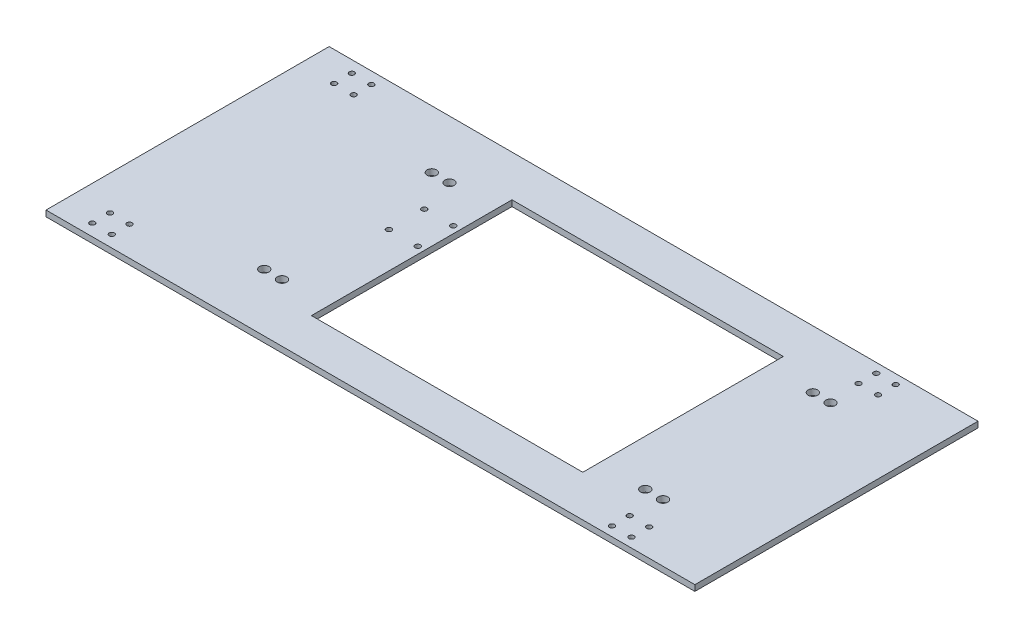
ISO-10303-21;
HEADER;
FILE_DESCRIPTION(('STEP AP214'),'2;1');
FILE_NAME('part.step','',(''),(''),'','','');
FILE_SCHEMA(('AUTOMOTIVE_DESIGN { 1 0 10303 214 1 1 1 1 }'));
ENDSEC;
DATA;
#1=APPLICATION_CONTEXT('core data for automotive mechanical design processes');
#2=APPLICATION_PROTOCOL_DEFINITION('international standard','automotive_design',2000,#1);
#3=PRODUCT_CONTEXT('',#1,'mechanical');
#4=PRODUCT('Part','Part','',(#3));
#5=PRODUCT_RELATED_PRODUCT_CATEGORY('part','',(#4));
#6=PRODUCT_DEFINITION_FORMATION('','',#4);
#7=PRODUCT_DEFINITION_CONTEXT('part definition',#1,'design');
#8=PRODUCT_DEFINITION('design','',#6,#7);
#9=PRODUCT_DEFINITION_SHAPE('','',#8);
#10=(LENGTH_UNIT() NAMED_UNIT(*) SI_UNIT(.MILLI.,.METRE.));
#11=(NAMED_UNIT(*) PLANE_ANGLE_UNIT() SI_UNIT($,.RADIAN.));
#12=(NAMED_UNIT(*) SI_UNIT($,.STERADIAN.) SOLID_ANGLE_UNIT());
#13=UNCERTAINTY_MEASURE_WITH_UNIT(LENGTH_MEASURE(1.E-05),#10,'distance_accuracy_value','');
#14=(GEOMETRIC_REPRESENTATION_CONTEXT(3) GLOBAL_UNCERTAINTY_ASSIGNED_CONTEXT((#13)) GLOBAL_UNIT_ASSIGNED_CONTEXT((#10,
#11,#12)) REPRESENTATION_CONTEXT('',''));
#15=CARTESIAN_POINT('',(0.,0.,0.));
#16=DIRECTION('',(0.,0.,1.));
#17=DIRECTION('',(1.,0.,0.));
#18=AXIS2_PLACEMENT_3D('',#15,#16,#17);
#19=CARTESIAN_POINT('',(-275.,31.5,-120.));
#20=DIRECTION('',(1.,0.,0.));
#21=DIRECTION('',(0.,0.,-1.));
#22=AXIS2_PLACEMENT_3D('',#19,#20,#21);
#23=PLANE('',#22);
#24=DIRECTION('',(0.,-1.,0.));
#25=VECTOR('',#24,1.);
#26=CARTESIAN_POINT('',(-275.,31.5,120.));
#27=LINE('',#26,#25);
#28=CARTESIAN_POINT('',(-275.,5.,120.));
#29=VERTEX_POINT('',#28);
#30=CARTESIAN_POINT('',(-275.,0.,120.));
#31=VERTEX_POINT('',#30);
#32=EDGE_CURVE('E12',#29,#31,#27,.T.);
#33=ORIENTED_EDGE('',*,*,#32,.F.);
#34=DIRECTION('',(0.,0.,1.));
#35=VECTOR('',#34,1.);
#36=CARTESIAN_POINT('',(-275.,5.,-120.));
#37=LINE('',#36,#35);
#38=CARTESIAN_POINT('',(-275.,5.,-120.));
#39=VERTEX_POINT('',#38);
#40=EDGE_CURVE('E99',#39,#29,#37,.T.);
#41=ORIENTED_EDGE('',*,*,#40,.F.);
#42=DIRECTION('',(0.,-1.,0.));
#43=VECTOR('',#42,1.);
#44=CARTESIAN_POINT('',(-275.,31.5,-120.));
#45=LINE('',#44,#43);
#46=CARTESIAN_POINT('',(-275.,0.,-120.));
#47=VERTEX_POINT('',#46);
#48=EDGE_CURVE('E119',#39,#47,#45,.T.);
#49=ORIENTED_EDGE('',*,*,#48,.T.);
#50=DIRECTION('',(0.,0.,1.));
#51=VECTOR('',#50,1.);
#52=CARTESIAN_POINT('',(-275.,0.,-120.));
#53=LINE('',#52,#51);
#54=EDGE_CURVE('E117',#47,#31,#53,.T.);
#55=ORIENTED_EDGE('',*,*,#54,.T.);
#56=EDGE_LOOP('',(#33,#41,#49,#55));
#57=FACE_BOUND('',#56,.T.);
#58=ADVANCED_FACE('F37',(#57),#23,.F.);
#59=CARTESIAN_POINT('',(275.,31.5,120.));
#60=DIRECTION('',(0.,0.,-1.));
#61=DIRECTION('',(-1.,0.,0.));
#62=AXIS2_PLACEMENT_3D('',#59,#60,#61);
#63=PLANE('',#62);
#64=DIRECTION('',(0.,-1.,0.));
#65=VECTOR('',#64,1.);
#66=CARTESIAN_POINT('',(275.,31.5,120.));
#67=LINE('',#66,#65);
#68=CARTESIAN_POINT('',(275.,5.,120.));
#69=VERTEX_POINT('',#68);
#70=CARTESIAN_POINT('',(275.,0.,120.));
#71=VERTEX_POINT('',#70);
#72=EDGE_CURVE('E45',#69,#71,#67,.T.);
#73=ORIENTED_EDGE('',*,*,#72,.F.);
#74=DIRECTION('',(1.,0.,0.));
#75=VECTOR('',#74,1.);
#76=CARTESIAN_POINT('',(275.,5.,120.));
#77=LINE('',#76,#75);
#78=EDGE_CURVE('E103',#29,#69,#77,.T.);
#79=ORIENTED_EDGE('',*,*,#78,.F.);
#80=ORIENTED_EDGE('',*,*,#32,.T.);
#81=DIRECTION('',(1.,0.,0.));
#82=VECTOR('',#81,1.);
#83=CARTESIAN_POINT('',(275.,0.,120.));
#84=LINE('',#83,#82);
#85=EDGE_CURVE('E123',#31,#71,#84,.T.);
#86=ORIENTED_EDGE('',*,*,#85,.T.);
#87=EDGE_LOOP('',(#73,#79,#80,#86));
#88=FACE_BOUND('',#87,.T.);
#89=ADVANCED_FACE('F112',(#88),#63,.F.);
#90=CARTESIAN_POINT('',(275.,31.5,-120.));
#91=DIRECTION('',(-1.,0.,0.));
#92=DIRECTION('',(0.,0.,1.));
#93=AXIS2_PLACEMENT_3D('',#90,#91,#92);
#94=PLANE('',#93);
#95=DIRECTION('',(0.,-1.,0.));
#96=VECTOR('',#95,1.);
#97=CARTESIAN_POINT('',(275.,31.5,-120.));
#98=LINE('',#97,#96);
#99=CARTESIAN_POINT('',(275.,5.,-120.));
#100=VERTEX_POINT('',#99);
#101=CARTESIAN_POINT('',(275.,0.,-120.));
#102=VERTEX_POINT('',#101);
#103=EDGE_CURVE('E138',#100,#102,#98,.T.);
#104=ORIENTED_EDGE('',*,*,#103,.F.);
#105=DIRECTION('',(0.,0.,-1.));
#106=VECTOR('',#105,1.);
#107=CARTESIAN_POINT('',(275.,5.,-120.));
#108=LINE('',#107,#106);
#109=EDGE_CURVE('E52',#69,#100,#108,.T.);
#110=ORIENTED_EDGE('',*,*,#109,.F.);
#111=ORIENTED_EDGE('',*,*,#72,.T.);
#112=DIRECTION('',(0.,0.,-1.));
#113=VECTOR('',#112,1.);
#114=CARTESIAN_POINT('',(275.,0.,-120.));
#115=LINE('',#114,#113);
#116=EDGE_CURVE('E130',#71,#102,#115,.T.);
#117=ORIENTED_EDGE('',*,*,#116,.T.);
#118=EDGE_LOOP('',(#104,#110,#111,#117));
#119=FACE_BOUND('',#118,.T.);
#120=ADVANCED_FACE('F142',(#119),#94,.F.);
#121=CARTESIAN_POINT('',(275.,31.5,-120.));
#122=DIRECTION('',(0.,0.,1.));
#123=DIRECTION('',(1.,0.,0.));
#124=AXIS2_PLACEMENT_3D('',#121,#122,#123);
#125=PLANE('',#124);
#126=ORIENTED_EDGE('',*,*,#48,.F.);
#127=DIRECTION('',(-1.,0.,0.));
#128=VECTOR('',#127,1.);
#129=CARTESIAN_POINT('',(275.,5.,-120.));
#130=LINE('',#129,#128);
#131=EDGE_CURVE('E104',#100,#39,#130,.T.);
#132=ORIENTED_EDGE('',*,*,#131,.F.);
#133=ORIENTED_EDGE('',*,*,#103,.T.);
#134=DIRECTION('',(-1.,0.,0.));
#135=VECTOR('',#134,1.);
#136=CARTESIAN_POINT('',(275.,0.,-120.));
#137=LINE('',#136,#135);
#138=EDGE_CURVE('E132',#102,#47,#137,.T.);
#139=ORIENTED_EDGE('',*,*,#138,.T.);
#140=EDGE_LOOP('',(#126,#132,#133,#139));
#141=FACE_BOUND('',#140,.T.);
#142=ADVANCED_FACE('F307',(#141),#125,.F.);
#143=CARTESIAN_POINT('',(0.,0.,0.));
#144=DIRECTION('',(0.,-1.,0.));
#145=DIRECTION('',(0.,0.,-1.));
#146=AXIS2_PLACEMENT_3D('',#143,#144,#145);
#147=PLANE('',#146);
#148=CARTESIAN_POINT('',(-139.,0.,71.0000000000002));
#149=DIRECTION('',(0.,-1.,0.));
#150=DIRECTION('',(0.,0.,-1.));
#151=AXIS2_PLACEMENT_3D('',#148,#149,#150);
#152=CIRCLE('',#151,3.99999999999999);
#153=CARTESIAN_POINT('',(-139.,0.,67.0000000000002));
#154=VERTEX_POINT('',#153);
#155=EDGE_CURVE('E677',#154,#154,#152,.T.);
#156=ORIENTED_EDGE('',*,*,#155,.F.);
#157=EDGE_LOOP('',(#156));
#158=FACE_BOUND('',#157,.T.);
#159=CARTESIAN_POINT('',(199.,0.,71.0000000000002));
#160=DIRECTION('',(0.,-1.,0.));
#161=DIRECTION('',(0.,0.,1.));
#162=AXIS2_PLACEMENT_3D('',#159,#160,#161);
#163=CIRCLE('',#162,3.99999999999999);
#164=CARTESIAN_POINT('',(199.,0.,75.0000000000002));
#165=VERTEX_POINT('',#164);
#166=EDGE_CURVE('E680',#165,#165,#163,.T.);
#167=ORIENTED_EDGE('',*,*,#166,.F.);
#168=EDGE_LOOP('',(#167));
#169=FACE_BOUND('',#168,.T.);
#170=CARTESIAN_POINT('',(184.,0.,71.0000000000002));
#171=DIRECTION('',(0.,-1.,0.));
#172=DIRECTION('',(0.,0.,1.));
#173=AXIS2_PLACEMENT_3D('',#170,#171,#172);
#174=CIRCLE('',#173,3.99999999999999);
#175=CARTESIAN_POINT('',(184.,0.,75.0000000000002));
#176=VERTEX_POINT('',#175);
#177=EDGE_CURVE('E697',#176,#176,#174,.T.);
#178=ORIENTED_EDGE('',*,*,#177,.F.);
#179=EDGE_LOOP('',(#178));
#180=FACE_BOUND('',#179,.T.);
#181=CARTESIAN_POINT('',(199.,0.,-71.0000000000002));
#182=DIRECTION('',(0.,-1.,0.));
#183=DIRECTION('',(0.,0.,-1.));
#184=AXIS2_PLACEMENT_3D('',#181,#182,#183);
#185=CIRCLE('',#184,3.99999999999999);
#186=CARTESIAN_POINT('',(199.,0.,-75.0000000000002));
#187=VERTEX_POINT('',#186);
#188=EDGE_CURVE('E689',#187,#187,#185,.T.);
#189=ORIENTED_EDGE('',*,*,#188,.F.);
#190=EDGE_LOOP('',(#189));
#191=FACE_BOUND('',#190,.T.);
#192=CARTESIAN_POINT('',(-124.,0.,71.0000000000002));
#193=DIRECTION('',(0.,-1.,0.));
#194=DIRECTION('',(0.,0.,-1.));
#195=AXIS2_PLACEMENT_3D('',#192,#193,#194);
#196=CIRCLE('',#195,3.99999999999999);
#197=CARTESIAN_POINT('',(-124.,0.,67.0000000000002));
#198=VERTEX_POINT('',#197);
#199=EDGE_CURVE('E683',#198,#198,#196,.T.);
#200=ORIENTED_EDGE('',*,*,#199,.F.);
#201=EDGE_LOOP('',(#200));
#202=FACE_BOUND('',#201,.T.);
#203=CARTESIAN_POINT('',(-124.,0.,-71.0000000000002));
#204=DIRECTION('',(0.,-1.,0.));
#205=DIRECTION('',(0.,0.,1.));
#206=AXIS2_PLACEMENT_3D('',#203,#204,#205);
#207=CIRCLE('',#206,3.99999999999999);
#208=CARTESIAN_POINT('',(-124.,0.,-67.0000000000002));
#209=VERTEX_POINT('',#208);
#210=EDGE_CURVE('E809',#209,#209,#207,.T.);
#211=ORIENTED_EDGE('',*,*,#210,.F.);
#212=EDGE_LOOP('',(#211));
#213=FACE_BOUND('',#212,.T.);
#214=CARTESIAN_POINT('',(-139.,0.,-71.0000000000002));
#215=DIRECTION('',(0.,-1.,0.));
#216=DIRECTION('',(0.,0.,1.));
#217=AXIS2_PLACEMENT_3D('',#214,#215,#216);
#218=CIRCLE('',#217,3.99999999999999);
#219=CARTESIAN_POINT('',(-139.,0.,-67.0000000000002));
#220=VERTEX_POINT('',#219);
#221=EDGE_CURVE('E810',#220,#220,#218,.T.);
#222=ORIENTED_EDGE('',*,*,#221,.F.);
#223=EDGE_LOOP('',(#222));
#224=FACE_BOUND('',#223,.T.);
#225=CARTESIAN_POINT('',(184.,0.,-71.0000000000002));
#226=DIRECTION('',(0.,-1.,0.));
#227=DIRECTION('',(0.,0.,-1.));
#228=AXIS2_PLACEMENT_3D('',#225,#226,#227);
#229=CIRCLE('',#228,3.99999999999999);
#230=CARTESIAN_POINT('',(184.,0.,-75.0000000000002));
#231=VERTEX_POINT('',#230);
#232=EDGE_CURVE('E696',#231,#231,#229,.T.);
#233=ORIENTED_EDGE('',*,*,#232,.F.);
#234=EDGE_LOOP('',(#233));
#235=FACE_BOUND('',#234,.T.);
#236=CARTESIAN_POINT('',(196.75,0.,-96.9999999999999));
#237=DIRECTION('',(0.,-1.,0.));
#238=DIRECTION('',(0.,0.,-1.));
#239=AXIS2_PLACEMENT_3D('',#236,#237,#238);
#240=CIRCLE('',#239,2.20000000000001);
#241=CARTESIAN_POINT('',(196.75,0.,-99.1999999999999));
#242=VERTEX_POINT('',#241);
#243=EDGE_CURVE('E233',#242,#242,#240,.T.);
#244=ORIENTED_EDGE('',*,*,#243,.F.);
#245=EDGE_LOOP('',(#244));
#246=FACE_BOUND('',#245,.T.);
#247=CARTESIAN_POINT('',(213.25,0.,112.));
#248=DIRECTION('',(0.,-1.,0.));
#249=DIRECTION('',(0.,0.,-1.));
#250=AXIS2_PLACEMENT_3D('',#247,#248,#249);
#251=CIRCLE('',#250,2.20000000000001);
#252=CARTESIAN_POINT('',(213.25,0.,109.8));
#253=VERTEX_POINT('',#252);
#254=EDGE_CURVE('E230',#253,#253,#251,.T.);
#255=ORIENTED_EDGE('',*,*,#254,.F.);
#256=EDGE_LOOP('',(#255));
#257=FACE_BOUND('',#256,.T.);
#258=CARTESIAN_POINT('',(213.25,0.,96.9999999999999));
#259=DIRECTION('',(0.,-1.,0.));
#260=DIRECTION('',(0.,0.,-1.));
#261=AXIS2_PLACEMENT_3D('',#258,#259,#260);
#262=CIRCLE('',#261,2.20000000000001);
#263=CARTESIAN_POINT('',(213.25,0.,94.7999999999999));
#264=VERTEX_POINT('',#263);
#265=EDGE_CURVE('E227',#264,#264,#262,.T.);
#266=ORIENTED_EDGE('',*,*,#265,.F.);
#267=EDGE_LOOP('',(#266));
#268=FACE_BOUND('',#267,.T.);
#269=CARTESIAN_POINT('',(196.75,0.,96.9999999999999));
#270=DIRECTION('',(0.,-1.,0.));
#271=DIRECTION('',(0.,0.,-1.));
#272=AXIS2_PLACEMENT_3D('',#269,#270,#271);
#273=CIRCLE('',#272,2.20000000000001);
#274=CARTESIAN_POINT('',(196.75,0.,94.7999999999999));
#275=VERTEX_POINT('',#274);
#276=EDGE_CURVE('E224',#275,#275,#273,.T.);
#277=ORIENTED_EDGE('',*,*,#276,.F.);
#278=EDGE_LOOP('',(#277));
#279=FACE_BOUND('',#278,.T.);
#280=CARTESIAN_POINT('',(196.75,0.,-112.));
#281=DIRECTION('',(0.,-1.,0.));
#282=DIRECTION('',(0.,0.,-1.));
#283=AXIS2_PLACEMENT_3D('',#280,#281,#282);
#284=CIRCLE('',#283,2.20000000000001);
#285=CARTESIAN_POINT('',(196.75,0.,-114.2));
#286=VERTEX_POINT('',#285);
#287=EDGE_CURVE('E221',#286,#286,#284,.T.);
#288=ORIENTED_EDGE('',*,*,#287,.F.);
#289=EDGE_LOOP('',(#288));
#290=FACE_BOUND('',#289,.T.);
#291=CARTESIAN_POINT('',(213.25,0.,-112.));
#292=DIRECTION('',(0.,-1.,0.));
#293=DIRECTION('',(0.,0.,-1.));
#294=AXIS2_PLACEMENT_3D('',#291,#292,#293);
#295=CIRCLE('',#294,2.20000000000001);
#296=CARTESIAN_POINT('',(213.25,0.,-114.2));
#297=VERTEX_POINT('',#296);
#298=EDGE_CURVE('E218',#297,#297,#295,.T.);
#299=ORIENTED_EDGE('',*,*,#298,.F.);
#300=EDGE_LOOP('',(#299));
#301=FACE_BOUND('',#300,.T.);
#302=CARTESIAN_POINT('',(213.25,0.,-96.9999999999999));
#303=DIRECTION('',(0.,-1.,0.));
#304=DIRECTION('',(0.,0.,-1.));
#305=AXIS2_PLACEMENT_3D('',#302,#303,#304);
#306=CIRCLE('',#305,2.20000000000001);
#307=CARTESIAN_POINT('',(213.25,0.,-99.1999999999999));
#308=VERTEX_POINT('',#307);
#309=EDGE_CURVE('E215',#308,#308,#306,.T.);
#310=ORIENTED_EDGE('',*,*,#309,.F.);
#311=EDGE_LOOP('',(#310));
#312=FACE_BOUND('',#311,.T.);
#313=CARTESIAN_POINT('',(196.75,0.,112.));
#314=DIRECTION('',(0.,-1.,0.));
#315=DIRECTION('',(0.,0.,-1.));
#316=AXIS2_PLACEMENT_3D('',#313,#314,#315);
#317=CIRCLE('',#316,2.20000000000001);
#318=CARTESIAN_POINT('',(196.75,0.,109.8));
#319=VERTEX_POINT('',#318);
#320=EDGE_CURVE('E212',#319,#319,#317,.T.);
#321=ORIENTED_EDGE('',*,*,#320,.F.);
#322=EDGE_LOOP('',(#321));
#323=FACE_BOUND('',#322,.T.);
#324=CARTESIAN_POINT('',(-115.312216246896,0.,-10.9807621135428));
#325=DIRECTION('',(0.,-1.,0.));
#326=DIRECTION('',(0.,0.,1.));
#327=AXIS2_PLACEMENT_3D('',#324,#325,#326);
#328=CIRCLE('',#327,2.25);
#329=CARTESIAN_POINT('',(-115.312216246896,0.,-8.7307621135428));
#330=VERTEX_POINT('',#329);
#331=EDGE_CURVE('E240',#330,#330,#328,.T.);
#332=ORIENTED_EDGE('',*,*,#331,.F.);
#333=EDGE_LOOP('',(#332));
#334=FACE_BOUND('',#333,.T.);
#335=CARTESIAN_POINT('',(-90.8122162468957,0.,-40.9807621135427));
#336=DIRECTION('',(0.,-1.,0.));
#337=DIRECTION('',(0.,0.,1.));
#338=AXIS2_PLACEMENT_3D('',#335,#336,#337);
#339=CIRCLE('',#338,2.24999999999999);
#340=CARTESIAN_POINT('',(-90.8122162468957,0.,-38.7307621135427));
#341=VERTEX_POINT('',#340);
#342=EDGE_CURVE('E239',#341,#341,#339,.T.);
#343=ORIENTED_EDGE('',*,*,#342,.F.);
#344=EDGE_LOOP('',(#343));
#345=FACE_BOUND('',#344,.T.);
#346=CARTESIAN_POINT('',(-90.8122162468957,0.,-10.9807621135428));
#347=DIRECTION('',(0.,-1.,0.));
#348=DIRECTION('',(0.,0.,-1.));
#349=AXIS2_PLACEMENT_3D('',#346,#347,#348);
#350=CIRCLE('',#349,2.25);
#351=CARTESIAN_POINT('',(-90.8122162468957,0.,-13.2307621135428));
#352=VERTEX_POINT('',#351);
#353=EDGE_CURVE('E236',#352,#352,#350,.T.);
#354=ORIENTED_EDGE('',*,*,#353,.F.);
#355=EDGE_LOOP('',(#354));
#356=FACE_BOUND('',#355,.T.);
#357=CARTESIAN_POINT('',(-115.312216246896,0.,-40.9807621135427));
#358=DIRECTION('',(0.,-1.,0.));
#359=DIRECTION('',(0.,0.,-1.));
#360=AXIS2_PLACEMENT_3D('',#357,#358,#359);
#361=CIRCLE('',#360,2.25);
#362=CARTESIAN_POINT('',(-115.312216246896,0.,-43.2307621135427));
#363=VERTEX_POINT('',#362);
#364=EDGE_CURVE('E243',#363,#363,#361,.T.);
#365=ORIENTED_EDGE('',*,*,#364,.F.);
#366=EDGE_LOOP('',(#365));
#367=FACE_BOUND('',#366,.T.);
#368=ORIENTED_EDGE('',*,*,#85,.F.);
#369=ORIENTED_EDGE('',*,*,#54,.F.);
#370=ORIENTED_EDGE('',*,*,#138,.F.);
#371=ORIENTED_EDGE('',*,*,#116,.F.);
#372=EDGE_LOOP('',(#368,#369,#370,#371));
#373=FACE_BOUND('',#372,.T.);
#374=CARTESIAN_POINT('',(-229.25,0.,-95.));
#375=DIRECTION('',(0.,-1.,0.));
#376=DIRECTION('',(0.,0.,-1.));
#377=AXIS2_PLACEMENT_3D('',#374,#375,#376);
#378=CIRCLE('',#377,2.19999999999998);
#379=CARTESIAN_POINT('',(-229.25,0.,-97.1999999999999));
#380=VERTEX_POINT('',#379);
#381=EDGE_CURVE('E257',#380,#380,#378,.F.);
#382=ORIENTED_EDGE('',*,*,#381,.T.);
#383=EDGE_LOOP('',(#382));
#384=FACE_BOUND('',#383,.T.);
#385=CARTESIAN_POINT('',(-229.25,0.,-110.));
#386=DIRECTION('',(0.,-1.,0.));
#387=DIRECTION('',(0.,0.,-1.));
#388=AXIS2_PLACEMENT_3D('',#385,#386,#387);
#389=CIRCLE('',#388,2.19999999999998);
#390=CARTESIAN_POINT('',(-229.25,0.,-112.2));
#391=VERTEX_POINT('',#390);
#392=EDGE_CURVE('E254',#391,#391,#389,.F.);
#393=ORIENTED_EDGE('',*,*,#392,.T.);
#394=EDGE_LOOP('',(#393));
#395=FACE_BOUND('',#394,.T.);
#396=CARTESIAN_POINT('',(-245.75,0.,-110.));
#397=DIRECTION('',(0.,-1.,0.));
#398=DIRECTION('',(0.,0.,-1.));
#399=AXIS2_PLACEMENT_3D('',#396,#397,#398);
#400=CIRCLE('',#399,2.19999999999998);
#401=CARTESIAN_POINT('',(-245.75,0.,-112.2));
#402=VERTEX_POINT('',#401);
#403=EDGE_CURVE('E251',#402,#402,#400,.F.);
#404=ORIENTED_EDGE('',*,*,#403,.T.);
#405=EDGE_LOOP('',(#404));
#406=FACE_BOUND('',#405,.T.);
#407=CARTESIAN_POINT('',(-245.75,0.,-95.));
#408=DIRECTION('',(0.,-1.,0.));
#409=DIRECTION('',(0.,0.,-1.));
#410=AXIS2_PLACEMENT_3D('',#407,#408,#409);
#411=CIRCLE('',#410,2.19999999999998);
#412=CARTESIAN_POINT('',(-245.75,0.,-97.1999999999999));
#413=VERTEX_POINT('',#412);
#414=EDGE_CURVE('E248',#413,#413,#411,.F.);
#415=ORIENTED_EDGE('',*,*,#414,.T.);
#416=EDGE_LOOP('',(#415));
#417=FACE_BOUND('',#416,.T.);
#418=CARTESIAN_POINT('',(-229.25,0.,95.));
#419=DIRECTION('',(0.,-1.,0.));
#420=DIRECTION('',(0.,0.,-1.));
#421=AXIS2_PLACEMENT_3D('',#418,#419,#420);
#422=CIRCLE('',#421,2.19999999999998);
#423=CARTESIAN_POINT('',(-229.25,0.,92.8));
#424=VERTEX_POINT('',#423);
#425=EDGE_CURVE('E269',#424,#424,#422,.T.);
#426=ORIENTED_EDGE('',*,*,#425,.F.);
#427=EDGE_LOOP('',(#426));
#428=FACE_BOUND('',#427,.T.);
#429=CARTESIAN_POINT('',(-229.25,0.,110.));
#430=DIRECTION('',(0.,-1.,0.));
#431=DIRECTION('',(0.,0.,-1.));
#432=AXIS2_PLACEMENT_3D('',#429,#430,#431);
#433=CIRCLE('',#432,2.19999999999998);
#434=CARTESIAN_POINT('',(-229.25,0.,107.8));
#435=VERTEX_POINT('',#434);
#436=EDGE_CURVE('E266',#435,#435,#433,.T.);
#437=ORIENTED_EDGE('',*,*,#436,.F.);
#438=EDGE_LOOP('',(#437));
#439=FACE_BOUND('',#438,.T.);
#440=CARTESIAN_POINT('',(-245.75,0.,110.));
#441=DIRECTION('',(0.,-1.,0.));
#442=DIRECTION('',(0.,0.,-1.));
#443=AXIS2_PLACEMENT_3D('',#440,#441,#442);
#444=CIRCLE('',#443,2.19999999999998);
#445=CARTESIAN_POINT('',(-245.75,0.,107.8));
#446=VERTEX_POINT('',#445);
#447=EDGE_CURVE('E263',#446,#446,#444,.T.);
#448=ORIENTED_EDGE('',*,*,#447,.F.);
#449=EDGE_LOOP('',(#448));
#450=FACE_BOUND('',#449,.T.);
#451=CARTESIAN_POINT('',(-245.75,0.,95.));
#452=DIRECTION('',(0.,-1.,0.));
#453=DIRECTION('',(0.,0.,-1.));
#454=AXIS2_PLACEMENT_3D('',#451,#452,#453);
#455=CIRCLE('',#454,2.19999999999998);
#456=CARTESIAN_POINT('',(-245.75,0.,92.8));
#457=VERTEX_POINT('',#456);
#458=EDGE_CURVE('E260',#457,#457,#455,.T.);
#459=ORIENTED_EDGE('',*,*,#458,.F.);
#460=EDGE_LOOP('',(#459));
#461=FACE_BOUND('',#460,.T.);
#462=DIRECTION('',(0.,0.,1.));
#463=VECTOR('',#462,1.);
#464=CARTESIAN_POINT('',(-85.,0.,-85.));
#465=LINE('',#464,#463);
#466=CARTESIAN_POINT('',(-85.,0.,-85.));
#467=VERTEX_POINT('',#466);
#468=CARTESIAN_POINT('',(-85.,0.,85.));
#469=VERTEX_POINT('',#468);
#470=EDGE_CURVE('E272',#467,#469,#465,.T.);
#471=ORIENTED_EDGE('',*,*,#470,.T.);
#472=DIRECTION('',(1.,0.,0.));
#473=VECTOR('',#472,1.);
#474=CARTESIAN_POINT('',(145.,0.,85.));
#475=LINE('',#474,#473);
#476=CARTESIAN_POINT('',(145.,0.,85.));
#477=VERTEX_POINT('',#476);
#478=EDGE_CURVE('E275',#469,#477,#475,.T.);
#479=ORIENTED_EDGE('',*,*,#478,.T.);
#480=DIRECTION('',(0.,0.,-1.));
#481=VECTOR('',#480,1.);
#482=CARTESIAN_POINT('',(145.,0.,-85.));
#483=LINE('',#482,#481);
#484=CARTESIAN_POINT('',(145.,0.,-85.));
#485=VERTEX_POINT('',#484);
#486=EDGE_CURVE('E278',#477,#485,#483,.T.);
#487=ORIENTED_EDGE('',*,*,#486,.T.);
#488=DIRECTION('',(-1.,0.,0.));
#489=VECTOR('',#488,1.);
#490=CARTESIAN_POINT('',(145.,0.,-85.));
#491=LINE('',#490,#489);
#492=EDGE_CURVE('E281',#485,#467,#491,.T.);
#493=ORIENTED_EDGE('',*,*,#492,.T.);
#494=EDGE_LOOP('',(#471,#479,#487,#493));
#495=FACE_BOUND('',#494,.T.);
#496=ADVANCED_FACE('F127',(#158,#169,#180,#191,#202,#213,#224,#235,#246,#257,#268,#279,#290,
#301,#312,#323,#334,#345,#356,#367,#373,#384,#395,#406,#417,#428,#439,#450,#461,#495),#147,.T.);
#497=CARTESIAN_POINT('',(-85.,0.,-85.));
#498=DIRECTION('',(-1.,0.,0.));
#499=DIRECTION('',(0.,0.,1.));
#500=AXIS2_PLACEMENT_3D('',#497,#498,#499);
#501=PLANE('',#500);
#502=DIRECTION('',(0.,1.,0.));
#503=VECTOR('',#502,1.);
#504=CARTESIAN_POINT('',(-85.,0.,-85.));
#505=LINE('',#504,#503);
#506=CARTESIAN_POINT('',(-85.,5.,-85.));
#507=VERTEX_POINT('',#506);
#508=EDGE_CURVE('E124',#467,#507,#505,.T.);
#509=ORIENTED_EDGE('',*,*,#508,.T.);
#510=DIRECTION('',(0.,0.,1.));
#511=VECTOR('',#510,1.);
#512=CARTESIAN_POINT('',(-85.,5.,-85.));
#513=LINE('',#512,#511);
#514=CARTESIAN_POINT('',(-85.,5.,85.));
#515=VERTEX_POINT('',#514);
#516=EDGE_CURVE('E209',#507,#515,#513,.T.);
#517=ORIENTED_EDGE('',*,*,#516,.T.);
#518=DIRECTION('',(0.,1.,0.));
#519=VECTOR('',#518,1.);
#520=CARTESIAN_POINT('',(-85.,0.,85.));
#521=LINE('',#520,#519);
#522=EDGE_CURVE('E284',#469,#515,#521,.T.);
#523=ORIENTED_EDGE('',*,*,#522,.F.);
#524=ORIENTED_EDGE('',*,*,#470,.F.);
#525=EDGE_LOOP('',(#509,#517,#523,#524));
#526=FACE_BOUND('',#525,.T.);
#527=ADVANCED_FACE('F299',(#526),#501,.F.);
#528=CARTESIAN_POINT('',(145.,0.,-85.));
#529=DIRECTION('',(0.,0.,-1.));
#530=DIRECTION('',(-1.,0.,0.));
#531=AXIS2_PLACEMENT_3D('',#528,#529,#530);
#532=PLANE('',#531);
#533=DIRECTION('',(0.,1.,0.));
#534=VECTOR('',#533,1.);
#535=CARTESIAN_POINT('',(145.,0.,-85.));
#536=LINE('',#535,#534);
#537=CARTESIAN_POINT('',(145.,5.,-85.));
#538=VERTEX_POINT('',#537);
#539=EDGE_CURVE('E287',#485,#538,#536,.T.);
#540=ORIENTED_EDGE('',*,*,#539,.T.);
#541=DIRECTION('',(-1.,0.,0.));
#542=VECTOR('',#541,1.);
#543=CARTESIAN_POINT('',(145.,5.,-85.));
#544=LINE('',#543,#542);
#545=EDGE_CURVE('E206',#538,#507,#544,.T.);
#546=ORIENTED_EDGE('',*,*,#545,.T.);
#547=ORIENTED_EDGE('',*,*,#508,.F.);
#548=ORIENTED_EDGE('',*,*,#492,.F.);
#549=EDGE_LOOP('',(#540,#546,#547,#548));
#550=FACE_BOUND('',#549,.T.);
#551=ADVANCED_FACE('F301',(#550),#532,.F.);
#552=CARTESIAN_POINT('',(145.,0.,-85.));
#553=DIRECTION('',(1.,0.,0.));
#554=DIRECTION('',(0.,0.,-1.));
#555=AXIS2_PLACEMENT_3D('',#552,#553,#554);
#556=PLANE('',#555);
#557=DIRECTION('',(0.,1.,0.));
#558=VECTOR('',#557,1.);
#559=CARTESIAN_POINT('',(145.,0.,85.));
#560=LINE('',#559,#558);
#561=CARTESIAN_POINT('',(145.,5.,85.));
#562=VERTEX_POINT('',#561);
#563=EDGE_CURVE('E290',#477,#562,#560,.T.);
#564=ORIENTED_EDGE('',*,*,#563,.T.);
#565=DIRECTION('',(0.,0.,-1.));
#566=VECTOR('',#565,1.);
#567=CARTESIAN_POINT('',(145.,5.,-85.));
#568=LINE('',#567,#566);
#569=EDGE_CURVE('E60',#562,#538,#568,.T.);
#570=ORIENTED_EDGE('',*,*,#569,.T.);
#571=ORIENTED_EDGE('',*,*,#539,.F.);
#572=ORIENTED_EDGE('',*,*,#486,.F.);
#573=EDGE_LOOP('',(#564,#570,#571,#572));
#574=FACE_BOUND('',#573,.T.);
#575=ADVANCED_FACE('F304',(#574),#556,.F.);
#576=CARTESIAN_POINT('',(145.,0.,85.));
#577=DIRECTION('',(0.,0.,1.));
#578=DIRECTION('',(1.,0.,0.));
#579=AXIS2_PLACEMENT_3D('',#576,#577,#578);
#580=PLANE('',#579);
#581=ORIENTED_EDGE('',*,*,#522,.T.);
#582=DIRECTION('',(1.,0.,0.));
#583=VECTOR('',#582,1.);
#584=CARTESIAN_POINT('',(145.,5.,85.));
#585=LINE('',#584,#583);
#586=EDGE_CURVE('E203',#515,#562,#585,.T.);
#587=ORIENTED_EDGE('',*,*,#586,.T.);
#588=ORIENTED_EDGE('',*,*,#563,.F.);
#589=ORIENTED_EDGE('',*,*,#478,.F.);
#590=EDGE_LOOP('',(#581,#587,#588,#589));
#591=FACE_BOUND('',#590,.T.);
#592=ADVANCED_FACE('F295',(#591),#580,.F.);
#593=CARTESIAN_POINT('',(-245.75,-3.,95.));
#594=DIRECTION('',(0.,1.,0.));
#595=DIRECTION('',(0.,0.,1.));
#596=AXIS2_PLACEMENT_3D('',#593,#594,#595);
#597=CYLINDRICAL_SURFACE('',#596,2.19999999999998);
#598=CARTESIAN_POINT('',(-245.75,5.,95.));
#599=DIRECTION('',(0.,-1.,0.));
#600=DIRECTION('',(0.,0.,-1.));
#601=AXIS2_PLACEMENT_3D('',#598,#599,#600);
#602=CIRCLE('',#601,2.19999999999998);
#603=CARTESIAN_POINT('',(-245.75,5.,92.8));
#604=VERTEX_POINT('',#603);
#605=EDGE_CURVE('E200',#604,#604,#602,.F.);
#606=ORIENTED_EDGE('',*,*,#605,.T.);
#607=EDGE_LOOP('',(#606));
#608=FACE_BOUND('',#607,.T.);
#609=ORIENTED_EDGE('',*,*,#458,.T.);
#610=EDGE_LOOP('',(#609));
#611=FACE_BOUND('',#610,.T.);
#612=ADVANCED_FACE('F368',(#608,#611),#597,.F.);
#613=CARTESIAN_POINT('',(-245.75,-3.,110.));
#614=DIRECTION('',(0.,1.,0.));
#615=DIRECTION('',(0.,0.,1.));
#616=AXIS2_PLACEMENT_3D('',#613,#614,#615);
#617=CYLINDRICAL_SURFACE('',#616,2.19999999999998);
#618=CARTESIAN_POINT('',(-245.75,5.,110.));
#619=DIRECTION('',(0.,-1.,0.));
#620=DIRECTION('',(0.,0.,-1.));
#621=AXIS2_PLACEMENT_3D('',#618,#619,#620);
#622=CIRCLE('',#621,2.19999999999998);
#623=CARTESIAN_POINT('',(-245.75,5.,107.8));
#624=VERTEX_POINT('',#623);
#625=EDGE_CURVE('E197',#624,#624,#622,.F.);
#626=ORIENTED_EDGE('',*,*,#625,.T.);
#627=EDGE_LOOP('',(#626));
#628=FACE_BOUND('',#627,.T.);
#629=ORIENTED_EDGE('',*,*,#447,.T.);
#630=EDGE_LOOP('',(#629));
#631=FACE_BOUND('',#630,.T.);
#632=ADVANCED_FACE('F378',(#628,#631),#617,.F.);
#633=CARTESIAN_POINT('',(-229.25,-3.,110.));
#634=DIRECTION('',(0.,1.,0.));
#635=DIRECTION('',(0.,0.,1.));
#636=AXIS2_PLACEMENT_3D('',#633,#634,#635);
#637=CYLINDRICAL_SURFACE('',#636,2.19999999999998);
#638=CARTESIAN_POINT('',(-229.25,5.,110.));
#639=DIRECTION('',(0.,-1.,0.));
#640=DIRECTION('',(0.,0.,-1.));
#641=AXIS2_PLACEMENT_3D('',#638,#639,#640);
#642=CIRCLE('',#641,2.19999999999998);
#643=CARTESIAN_POINT('',(-229.25,5.,107.8));
#644=VERTEX_POINT('',#643);
#645=EDGE_CURVE('E194',#644,#644,#642,.F.);
#646=ORIENTED_EDGE('',*,*,#645,.T.);
#647=EDGE_LOOP('',(#646));
#648=FACE_BOUND('',#647,.T.);
#649=ORIENTED_EDGE('',*,*,#436,.T.);
#650=EDGE_LOOP('',(#649));
#651=FACE_BOUND('',#650,.T.);
#652=ADVANCED_FACE('F390',(#648,#651),#637,.F.);
#653=CARTESIAN_POINT('',(-229.25,-3.,95.));
#654=DIRECTION('',(0.,1.,0.));
#655=DIRECTION('',(0.,0.,1.));
#656=AXIS2_PLACEMENT_3D('',#653,#654,#655);
#657=CYLINDRICAL_SURFACE('',#656,2.19999999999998);
#658=CARTESIAN_POINT('',(-229.25,5.,95.));
#659=DIRECTION('',(0.,-1.,0.));
#660=DIRECTION('',(0.,0.,-1.));
#661=AXIS2_PLACEMENT_3D('',#658,#659,#660);
#662=CIRCLE('',#661,2.19999999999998);
#663=CARTESIAN_POINT('',(-229.25,5.,92.8));
#664=VERTEX_POINT('',#663);
#665=EDGE_CURVE('E191',#664,#664,#662,.F.);
#666=ORIENTED_EDGE('',*,*,#665,.T.);
#667=EDGE_LOOP('',(#666));
#668=FACE_BOUND('',#667,.T.);
#669=ORIENTED_EDGE('',*,*,#425,.T.);
#670=EDGE_LOOP('',(#669));
#671=FACE_BOUND('',#670,.T.);
#672=ADVANCED_FACE('F401',(#668,#671),#657,.F.);
#673=CARTESIAN_POINT('',(-245.75,-3.,-95.));
#674=DIRECTION('',(0.,1.,0.));
#675=DIRECTION('',(0.,0.,1.));
#676=AXIS2_PLACEMENT_3D('',#673,#674,#675);
#677=CYLINDRICAL_SURFACE('',#676,2.19999999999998);
#678=CARTESIAN_POINT('',(-245.75,5.,-95.));
#679=DIRECTION('',(0.,-1.,0.));
#680=DIRECTION('',(0.,0.,-1.));
#681=AXIS2_PLACEMENT_3D('',#678,#679,#680);
#682=CIRCLE('',#681,2.19999999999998);
#683=CARTESIAN_POINT('',(-245.75,5.,-97.1999999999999));
#684=VERTEX_POINT('',#683);
#685=EDGE_CURVE('E188',#684,#684,#682,.T.);
#686=ORIENTED_EDGE('',*,*,#685,.F.);
#687=EDGE_LOOP('',(#686));
#688=FACE_BOUND('',#687,.T.);
#689=ORIENTED_EDGE('',*,*,#414,.F.);
#690=EDGE_LOOP('',(#689));
#691=FACE_BOUND('',#690,.T.);
#692=ADVANCED_FACE('F412',(#688,#691),#677,.F.);
#693=CARTESIAN_POINT('',(-245.75,-3.,-110.));
#694=DIRECTION('',(0.,1.,0.));
#695=DIRECTION('',(0.,0.,1.));
#696=AXIS2_PLACEMENT_3D('',#693,#694,#695);
#697=CYLINDRICAL_SURFACE('',#696,2.19999999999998);
#698=CARTESIAN_POINT('',(-245.75,5.,-110.));
#699=DIRECTION('',(0.,-1.,0.));
#700=DIRECTION('',(0.,0.,-1.));
#701=AXIS2_PLACEMENT_3D('',#698,#699,#700);
#702=CIRCLE('',#701,2.19999999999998);
#703=CARTESIAN_POINT('',(-245.75,5.,-112.2));
#704=VERTEX_POINT('',#703);
#705=EDGE_CURVE('E185',#704,#704,#702,.T.);
#706=ORIENTED_EDGE('',*,*,#705,.F.);
#707=EDGE_LOOP('',(#706));
#708=FACE_BOUND('',#707,.T.);
#709=ORIENTED_EDGE('',*,*,#403,.F.);
#710=EDGE_LOOP('',(#709));
#711=FACE_BOUND('',#710,.T.);
#712=ADVANCED_FACE('F422',(#708,#711),#697,.F.);
#713=CARTESIAN_POINT('',(-229.25,-3.,-110.));
#714=DIRECTION('',(0.,1.,0.));
#715=DIRECTION('',(0.,0.,1.));
#716=AXIS2_PLACEMENT_3D('',#713,#714,#715);
#717=CYLINDRICAL_SURFACE('',#716,2.19999999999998);
#718=CARTESIAN_POINT('',(-229.25,5.,-110.));
#719=DIRECTION('',(0.,-1.,0.));
#720=DIRECTION('',(0.,0.,-1.));
#721=AXIS2_PLACEMENT_3D('',#718,#719,#720);
#722=CIRCLE('',#721,2.19999999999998);
#723=CARTESIAN_POINT('',(-229.25,5.,-112.2));
#724=VERTEX_POINT('',#723);
#725=EDGE_CURVE('E182',#724,#724,#722,.T.);
#726=ORIENTED_EDGE('',*,*,#725,.F.);
#727=EDGE_LOOP('',(#726));
#728=FACE_BOUND('',#727,.T.);
#729=ORIENTED_EDGE('',*,*,#392,.F.);
#730=EDGE_LOOP('',(#729));
#731=FACE_BOUND('',#730,.T.);
#732=ADVANCED_FACE('F432',(#728,#731),#717,.F.);
#733=CARTESIAN_POINT('',(-229.25,-3.,-95.));
#734=DIRECTION('',(0.,1.,0.));
#735=DIRECTION('',(0.,0.,1.));
#736=AXIS2_PLACEMENT_3D('',#733,#734,#735);
#737=CYLINDRICAL_SURFACE('',#736,2.19999999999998);
#738=CARTESIAN_POINT('',(-229.25,5.,-95.));
#739=DIRECTION('',(0.,-1.,0.));
#740=DIRECTION('',(0.,0.,-1.));
#741=AXIS2_PLACEMENT_3D('',#738,#739,#740);
#742=CIRCLE('',#741,2.19999999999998);
#743=CARTESIAN_POINT('',(-229.25,5.,-97.1999999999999));
#744=VERTEX_POINT('',#743);
#745=EDGE_CURVE('E179',#744,#744,#742,.T.);
#746=ORIENTED_EDGE('',*,*,#745,.F.);
#747=EDGE_LOOP('',(#746));
#748=FACE_BOUND('',#747,.T.);
#749=ORIENTED_EDGE('',*,*,#381,.F.);
#750=EDGE_LOOP('',(#749));
#751=FACE_BOUND('',#750,.T.);
#752=ADVANCED_FACE('F443',(#748,#751),#737,.F.);
#753=CARTESIAN_POINT('',(-115.312216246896,16.,-40.9807621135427));
#754=DIRECTION('',(0.,-1.,0.));
#755=DIRECTION('',(0.,0.,-1.));
#756=AXIS2_PLACEMENT_3D('',#753,#754,#755);
#757=CYLINDRICAL_SURFACE('',#756,2.25);
#758=CARTESIAN_POINT('',(-115.312216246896,5.,-40.9807621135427));
#759=DIRECTION('',(0.,-1.,0.));
#760=DIRECTION('',(0.,0.,-1.));
#761=AXIS2_PLACEMENT_3D('',#758,#759,#760);
#762=CIRCLE('',#761,2.25);
#763=CARTESIAN_POINT('',(-115.312216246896,5.,-43.2307621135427));
#764=VERTEX_POINT('',#763);
#765=EDGE_CURVE('E176',#764,#764,#762,.F.);
#766=ORIENTED_EDGE('',*,*,#765,.T.);
#767=EDGE_LOOP('',(#766));
#768=FACE_BOUND('',#767,.T.);
#769=ORIENTED_EDGE('',*,*,#364,.T.);
#770=EDGE_LOOP('',(#769));
#771=FACE_BOUND('',#770,.T.);
#772=ADVANCED_FACE('F454',(#768,#771),#757,.F.);
#773=CARTESIAN_POINT('',(-90.8122162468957,16.,-10.9807621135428));
#774=DIRECTION('',(0.,-1.,0.));
#775=DIRECTION('',(0.,0.,-1.));
#776=AXIS2_PLACEMENT_3D('',#773,#774,#775);
#777=CYLINDRICAL_SURFACE('',#776,2.25);
#778=CARTESIAN_POINT('',(-90.8122162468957,5.,-10.9807621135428));
#779=DIRECTION('',(0.,-1.,0.));
#780=DIRECTION('',(0.,0.,-1.));
#781=AXIS2_PLACEMENT_3D('',#778,#779,#780);
#782=CIRCLE('',#781,2.25);
#783=CARTESIAN_POINT('',(-90.8122162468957,5.,-13.2307621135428));
#784=VERTEX_POINT('',#783);
#785=EDGE_CURVE('E173',#784,#784,#782,.F.);
#786=ORIENTED_EDGE('',*,*,#785,.T.);
#787=EDGE_LOOP('',(#786));
#788=FACE_BOUND('',#787,.T.);
#789=ORIENTED_EDGE('',*,*,#353,.T.);
#790=EDGE_LOOP('',(#789));
#791=FACE_BOUND('',#790,.T.);
#792=ADVANCED_FACE('F466',(#788,#791),#777,.F.);
#793=CARTESIAN_POINT('',(-90.8122162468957,16.,-40.9807621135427));
#794=DIRECTION('',(0.,-1.,0.));
#795=DIRECTION('',(0.,0.,-1.));
#796=AXIS2_PLACEMENT_3D('',#793,#794,#795);
#797=CYLINDRICAL_SURFACE('',#796,2.24999999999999);
#798=CARTESIAN_POINT('',(-90.8122162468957,5.,-40.9807621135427));
#799=DIRECTION('',(0.,-1.,0.));
#800=DIRECTION('',(0.,0.,-1.));
#801=AXIS2_PLACEMENT_3D('',#798,#799,#800);
#802=CIRCLE('',#801,2.24999999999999);
#803=CARTESIAN_POINT('',(-90.8122162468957,5.,-43.2307621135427));
#804=VERTEX_POINT('',#803);
#805=EDGE_CURVE('E170',#804,#804,#802,.F.);
#806=ORIENTED_EDGE('',*,*,#805,.T.);
#807=EDGE_LOOP('',(#806));
#808=FACE_BOUND('',#807,.T.);
#809=ORIENTED_EDGE('',*,*,#342,.T.);
#810=EDGE_LOOP('',(#809));
#811=FACE_BOUND('',#810,.T.);
#812=ADVANCED_FACE('F477',(#808,#811),#797,.F.);
#813=CARTESIAN_POINT('',(-115.312216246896,16.,-10.9807621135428));
#814=DIRECTION('',(0.,-1.,0.));
#815=DIRECTION('',(0.,0.,-1.));
#816=AXIS2_PLACEMENT_3D('',#813,#814,#815);
#817=CYLINDRICAL_SURFACE('',#816,2.25);
#818=CARTESIAN_POINT('',(-115.312216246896,5.,-10.9807621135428));
#819=DIRECTION('',(0.,-1.,0.));
#820=DIRECTION('',(0.,0.,-1.));
#821=AXIS2_PLACEMENT_3D('',#818,#819,#820);
#822=CIRCLE('',#821,2.25);
#823=CARTESIAN_POINT('',(-115.312216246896,5.,-13.2307621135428));
#824=VERTEX_POINT('',#823);
#825=EDGE_CURVE('E167',#824,#824,#822,.F.);
#826=ORIENTED_EDGE('',*,*,#825,.T.);
#827=EDGE_LOOP('',(#826));
#828=FACE_BOUND('',#827,.T.);
#829=ORIENTED_EDGE('',*,*,#331,.T.);
#830=EDGE_LOOP('',(#829));
#831=FACE_BOUND('',#830,.T.);
#832=ADVANCED_FACE('F487',(#828,#831),#817,.F.);
#833=CARTESIAN_POINT('',(196.75,-40.,112.));
#834=DIRECTION('',(0.,1.,0.));
#835=DIRECTION('',(0.,0.,1.));
#836=AXIS2_PLACEMENT_3D('',#833,#834,#835);
#837=CYLINDRICAL_SURFACE('',#836,2.20000000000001);
#838=CARTESIAN_POINT('',(196.75,5.,112.));
#839=DIRECTION('',(0.,-1.,0.));
#840=DIRECTION('',(0.,0.,-1.));
#841=AXIS2_PLACEMENT_3D('',#838,#839,#840);
#842=CIRCLE('',#841,2.20000000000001);
#843=CARTESIAN_POINT('',(196.75,5.,109.8));
#844=VERTEX_POINT('',#843);
#845=EDGE_CURVE('E164',#844,#844,#842,.F.);
#846=ORIENTED_EDGE('',*,*,#845,.T.);
#847=EDGE_LOOP('',(#846));
#848=FACE_BOUND('',#847,.T.);
#849=ORIENTED_EDGE('',*,*,#320,.T.);
#850=EDGE_LOOP('',(#849));
#851=FACE_BOUND('',#850,.T.);
#852=ADVANCED_FACE('F496',(#848,#851),#837,.F.);
#853=CARTESIAN_POINT('',(213.25,-40.,-96.9999999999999));
#854=DIRECTION('',(0.,1.,0.));
#855=DIRECTION('',(0.,0.,1.));
#856=AXIS2_PLACEMENT_3D('',#853,#854,#855);
#857=CYLINDRICAL_SURFACE('',#856,2.20000000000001);
#858=CARTESIAN_POINT('',(213.25,5.,-96.9999999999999));
#859=DIRECTION('',(0.,-1.,0.));
#860=DIRECTION('',(0.,0.,-1.));
#861=AXIS2_PLACEMENT_3D('',#858,#859,#860);
#862=CIRCLE('',#861,2.20000000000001);
#863=CARTESIAN_POINT('',(213.25,5.,-99.1999999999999));
#864=VERTEX_POINT('',#863);
#865=EDGE_CURVE('E161',#864,#864,#862,.F.);
#866=ORIENTED_EDGE('',*,*,#865,.T.);
#867=EDGE_LOOP('',(#866));
#868=FACE_BOUND('',#867,.T.);
#869=ORIENTED_EDGE('',*,*,#309,.T.);
#870=EDGE_LOOP('',(#869));
#871=FACE_BOUND('',#870,.T.);
#872=ADVANCED_FACE('F505',(#868,#871),#857,.F.);
#873=CARTESIAN_POINT('',(213.25,-40.,-112.));
#874=DIRECTION('',(0.,1.,0.));
#875=DIRECTION('',(0.,0.,1.));
#876=AXIS2_PLACEMENT_3D('',#873,#874,#875);
#877=CYLINDRICAL_SURFACE('',#876,2.20000000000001);
#878=CARTESIAN_POINT('',(213.25,5.,-112.));
#879=DIRECTION('',(0.,-1.,0.));
#880=DIRECTION('',(0.,0.,-1.));
#881=AXIS2_PLACEMENT_3D('',#878,#879,#880);
#882=CIRCLE('',#881,2.20000000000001);
#883=CARTESIAN_POINT('',(213.25,5.,-114.2));
#884=VERTEX_POINT('',#883);
#885=EDGE_CURVE('E158',#884,#884,#882,.F.);
#886=ORIENTED_EDGE('',*,*,#885,.T.);
#887=EDGE_LOOP('',(#886));
#888=FACE_BOUND('',#887,.T.);
#889=ORIENTED_EDGE('',*,*,#298,.T.);
#890=EDGE_LOOP('',(#889));
#891=FACE_BOUND('',#890,.T.);
#892=ADVANCED_FACE('F515',(#888,#891),#877,.F.);
#893=CARTESIAN_POINT('',(196.75,-40.,-112.));
#894=DIRECTION('',(0.,1.,0.));
#895=DIRECTION('',(0.,0.,1.));
#896=AXIS2_PLACEMENT_3D('',#893,#894,#895);
#897=CYLINDRICAL_SURFACE('',#896,2.20000000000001);
#898=CARTESIAN_POINT('',(196.75,5.,-112.));
#899=DIRECTION('',(0.,-1.,0.));
#900=DIRECTION('',(0.,0.,-1.));
#901=AXIS2_PLACEMENT_3D('',#898,#899,#900);
#902=CIRCLE('',#901,2.20000000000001);
#903=CARTESIAN_POINT('',(196.75,5.,-114.2));
#904=VERTEX_POINT('',#903);
#905=EDGE_CURVE('E155',#904,#904,#902,.F.);
#906=ORIENTED_EDGE('',*,*,#905,.T.);
#907=EDGE_LOOP('',(#906));
#908=FACE_BOUND('',#907,.T.);
#909=ORIENTED_EDGE('',*,*,#287,.T.);
#910=EDGE_LOOP('',(#909));
#911=FACE_BOUND('',#910,.T.);
#912=ADVANCED_FACE('F525',(#908,#911),#897,.F.);
#913=CARTESIAN_POINT('',(196.75,-40.,96.9999999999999));
#914=DIRECTION('',(0.,1.,0.));
#915=DIRECTION('',(0.,0.,1.));
#916=AXIS2_PLACEMENT_3D('',#913,#914,#915);
#917=CYLINDRICAL_SURFACE('',#916,2.20000000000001);
#918=CARTESIAN_POINT('',(196.75,5.,96.9999999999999));
#919=DIRECTION('',(0.,-1.,0.));
#920=DIRECTION('',(0.,0.,-1.));
#921=AXIS2_PLACEMENT_3D('',#918,#919,#920);
#922=CIRCLE('',#921,2.20000000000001);
#923=CARTESIAN_POINT('',(196.75,5.,94.7999999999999));
#924=VERTEX_POINT('',#923);
#925=EDGE_CURVE('E152',#924,#924,#922,.F.);
#926=ORIENTED_EDGE('',*,*,#925,.T.);
#927=EDGE_LOOP('',(#926));
#928=FACE_BOUND('',#927,.T.);
#929=ORIENTED_EDGE('',*,*,#276,.T.);
#930=EDGE_LOOP('',(#929));
#931=FACE_BOUND('',#930,.T.);
#932=ADVANCED_FACE('F535',(#928,#931),#917,.F.);
#933=CARTESIAN_POINT('',(213.25,-40.,96.9999999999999));
#934=DIRECTION('',(0.,1.,0.));
#935=DIRECTION('',(0.,0.,1.));
#936=AXIS2_PLACEMENT_3D('',#933,#934,#935);
#937=CYLINDRICAL_SURFACE('',#936,2.20000000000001);
#938=CARTESIAN_POINT('',(213.25,5.,96.9999999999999));
#939=DIRECTION('',(0.,-1.,0.));
#940=DIRECTION('',(0.,0.,-1.));
#941=AXIS2_PLACEMENT_3D('',#938,#939,#940);
#942=CIRCLE('',#941,2.20000000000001);
#943=CARTESIAN_POINT('',(213.25,5.,94.7999999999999));
#944=VERTEX_POINT('',#943);
#945=EDGE_CURVE('E149',#944,#944,#942,.F.);
#946=ORIENTED_EDGE('',*,*,#945,.T.);
#947=EDGE_LOOP('',(#946));
#948=FACE_BOUND('',#947,.T.);
#949=ORIENTED_EDGE('',*,*,#265,.T.);
#950=EDGE_LOOP('',(#949));
#951=FACE_BOUND('',#950,.T.);
#952=ADVANCED_FACE('F545',(#948,#951),#937,.F.);
#953=CARTESIAN_POINT('',(213.25,-40.,112.));
#954=DIRECTION('',(0.,1.,0.));
#955=DIRECTION('',(0.,0.,1.));
#956=AXIS2_PLACEMENT_3D('',#953,#954,#955);
#957=CYLINDRICAL_SURFACE('',#956,2.20000000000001);
#958=CARTESIAN_POINT('',(213.25,5.,112.));
#959=DIRECTION('',(0.,-1.,0.));
#960=DIRECTION('',(0.,0.,-1.));
#961=AXIS2_PLACEMENT_3D('',#958,#959,#960);
#962=CIRCLE('',#961,2.20000000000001);
#963=CARTESIAN_POINT('',(213.25,5.,109.8));
#964=VERTEX_POINT('',#963);
#965=EDGE_CURVE('E146',#964,#964,#962,.F.);
#966=ORIENTED_EDGE('',*,*,#965,.T.);
#967=EDGE_LOOP('',(#966));
#968=FACE_BOUND('',#967,.T.);
#969=ORIENTED_EDGE('',*,*,#254,.T.);
#970=EDGE_LOOP('',(#969));
#971=FACE_BOUND('',#970,.T.);
#972=ADVANCED_FACE('F555',(#968,#971),#957,.F.);
#973=CARTESIAN_POINT('',(196.75,-40.,-96.9999999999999));
#974=DIRECTION('',(0.,1.,0.));
#975=DIRECTION('',(0.,0.,1.));
#976=AXIS2_PLACEMENT_3D('',#973,#974,#975);
#977=CYLINDRICAL_SURFACE('',#976,2.20000000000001);
#978=CARTESIAN_POINT('',(196.75,5.,-96.9999999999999));
#979=DIRECTION('',(0.,-1.,0.));
#980=DIRECTION('',(0.,0.,-1.));
#981=AXIS2_PLACEMENT_3D('',#978,#979,#980);
#982=CIRCLE('',#981,2.20000000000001);
#983=CARTESIAN_POINT('',(196.75,5.,-99.1999999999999));
#984=VERTEX_POINT('',#983);
#985=EDGE_CURVE('E40',#984,#984,#982,.F.);
#986=ORIENTED_EDGE('',*,*,#985,.T.);
#987=EDGE_LOOP('',(#986));
#988=FACE_BOUND('',#987,.T.);
#989=ORIENTED_EDGE('',*,*,#243,.T.);
#990=EDGE_LOOP('',(#989));
#991=FACE_BOUND('',#990,.T.);
#992=ADVANCED_FACE('F565',(#988,#991),#977,.F.);
#993=CARTESIAN_POINT('',(0.,5.,0.));
#994=DIRECTION('',(0.,-1.,0.));
#995=DIRECTION('',(0.,0.,-1.));
#996=AXIS2_PLACEMENT_3D('',#993,#994,#995);
#997=PLANE('',#996);
#998=CARTESIAN_POINT('',(-139.,5.,71.0000000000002));
#999=DIRECTION('',(0.,-1.,0.));
#1000=DIRECTION('',(0.,0.,-1.));
#1001=AXIS2_PLACEMENT_3D('',#998,#999,#1000);
#1002=CIRCLE('',#1001,3.99999999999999);
#1003=CARTESIAN_POINT('',(-139.,5.,67.0000000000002));
#1004=VERTEX_POINT('',#1003);
#1005=EDGE_CURVE('E675',#1004,#1004,#1002,.F.);
#1006=ORIENTED_EDGE('',*,*,#1005,.F.);
#1007=EDGE_LOOP('',(#1006));
#1008=FACE_BOUND('',#1007,.T.);
#1009=CARTESIAN_POINT('',(199.,5.,71.0000000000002));
#1010=DIRECTION('',(0.,-1.,0.));
#1011=DIRECTION('',(0.,0.,-1.));
#1012=AXIS2_PLACEMENT_3D('',#1009,#1010,#1011);
#1013=CIRCLE('',#1012,3.99999999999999);
#1014=CARTESIAN_POINT('',(199.,5.,67.0000000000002));
#1015=VERTEX_POINT('',#1014);
#1016=EDGE_CURVE('E686',#1015,#1015,#1013,.F.);
#1017=ORIENTED_EDGE('',*,*,#1016,.F.);
#1018=EDGE_LOOP('',(#1017));
#1019=FACE_BOUND('',#1018,.T.);
#1020=CARTESIAN_POINT('',(184.,5.,71.0000000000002));
#1021=DIRECTION('',(0.,-1.,0.));
#1022=DIRECTION('',(0.,0.,-1.));
#1023=AXIS2_PLACEMENT_3D('',#1020,#1021,#1022);
#1024=CIRCLE('',#1023,3.99999999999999);
#1025=CARTESIAN_POINT('',(184.,5.,67.0000000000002));
#1026=VERTEX_POINT('',#1025);
#1027=EDGE_CURVE('E693',#1026,#1026,#1024,.F.);
#1028=ORIENTED_EDGE('',*,*,#1027,.F.);
#1029=EDGE_LOOP('',(#1028));
#1030=FACE_BOUND('',#1029,.T.);
#1031=CARTESIAN_POINT('',(199.,5.,-71.0000000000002));
#1032=DIRECTION('',(0.,-1.,0.));
#1033=DIRECTION('',(0.,0.,-1.));
#1034=AXIS2_PLACEMENT_3D('',#1031,#1032,#1033);
#1035=CIRCLE('',#1034,3.99999999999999);
#1036=CARTESIAN_POINT('',(199.,5.,-75.0000000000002));
#1037=VERTEX_POINT('',#1036);
#1038=EDGE_CURVE('E692',#1037,#1037,#1035,.F.);
#1039=ORIENTED_EDGE('',*,*,#1038,.F.);
#1040=EDGE_LOOP('',(#1039));
#1041=FACE_BOUND('',#1040,.T.);
#1042=CARTESIAN_POINT('',(-124.,5.,71.0000000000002));
#1043=DIRECTION('',(0.,-1.,0.));
#1044=DIRECTION('',(0.,0.,-1.));
#1045=AXIS2_PLACEMENT_3D('',#1042,#1043,#1044);
#1046=CIRCLE('',#1045,3.99999999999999);
#1047=CARTESIAN_POINT('',(-124.,5.,67.0000000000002));
#1048=VERTEX_POINT('',#1047);
#1049=EDGE_CURVE('E678',#1048,#1048,#1046,.F.);
#1050=ORIENTED_EDGE('',*,*,#1049,.F.);
#1051=EDGE_LOOP('',(#1050));
#1052=FACE_BOUND('',#1051,.T.);
#1053=CARTESIAN_POINT('',(-124.,5.,-71.0000000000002));
#1054=DIRECTION('',(0.,-1.,0.));
#1055=DIRECTION('',(0.,0.,-1.));
#1056=AXIS2_PLACEMENT_3D('',#1053,#1054,#1055);
#1057=CIRCLE('',#1056,3.99999999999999);
#1058=CARTESIAN_POINT('',(-124.,5.,-75.0000000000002));
#1059=VERTEX_POINT('',#1058);
#1060=EDGE_CURVE('E805',#1059,#1059,#1057,.F.);
#1061=ORIENTED_EDGE('',*,*,#1060,.F.);
#1062=EDGE_LOOP('',(#1061));
#1063=FACE_BOUND('',#1062,.T.);
#1064=CARTESIAN_POINT('',(-139.,5.,-71.0000000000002));
#1065=DIRECTION('',(0.,-1.,0.));
#1066=DIRECTION('',(0.,0.,-1.));
#1067=AXIS2_PLACEMENT_3D('',#1064,#1065,#1066);
#1068=CIRCLE('',#1067,3.99999999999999);
#1069=CARTESIAN_POINT('',(-139.,5.,-75.0000000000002));
#1070=VERTEX_POINT('',#1069);
#1071=EDGE_CURVE('E808',#1070,#1070,#1068,.F.);
#1072=ORIENTED_EDGE('',*,*,#1071,.F.);
#1073=EDGE_LOOP('',(#1072));
#1074=FACE_BOUND('',#1073,.T.);
#1075=CARTESIAN_POINT('',(184.,5.,-71.0000000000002));
#1076=DIRECTION('',(0.,-1.,0.));
#1077=DIRECTION('',(0.,0.,-1.));
#1078=AXIS2_PLACEMENT_3D('',#1075,#1076,#1077);
#1079=CIRCLE('',#1078,3.99999999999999);
#1080=CARTESIAN_POINT('',(184.,5.,-75.0000000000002));
#1081=VERTEX_POINT('',#1080);
#1082=EDGE_CURVE('E108',#1081,#1081,#1079,.F.);
#1083=ORIENTED_EDGE('',*,*,#1082,.F.);
#1084=EDGE_LOOP('',(#1083));
#1085=FACE_BOUND('',#1084,.T.);
#1086=ORIENTED_EDGE('',*,*,#625,.F.);
#1087=EDGE_LOOP('',(#1086));
#1088=FACE_BOUND('',#1087,.T.);
#1089=ORIENTED_EDGE('',*,*,#665,.F.);
#1090=EDGE_LOOP('',(#1089));
#1091=FACE_BOUND('',#1090,.T.);
#1092=ORIENTED_EDGE('',*,*,#685,.T.);
#1093=EDGE_LOOP('',(#1092));
#1094=FACE_BOUND('',#1093,.T.);
#1095=ORIENTED_EDGE('',*,*,#705,.T.);
#1096=EDGE_LOOP('',(#1095));
#1097=FACE_BOUND('',#1096,.T.);
#1098=ORIENTED_EDGE('',*,*,#725,.T.);
#1099=EDGE_LOOP('',(#1098));
#1100=FACE_BOUND('',#1099,.T.);
#1101=ORIENTED_EDGE('',*,*,#745,.T.);
#1102=EDGE_LOOP('',(#1101));
#1103=FACE_BOUND('',#1102,.T.);
#1104=ORIENTED_EDGE('',*,*,#785,.F.);
#1105=EDGE_LOOP('',(#1104));
#1106=FACE_BOUND('',#1105,.T.);
#1107=ORIENTED_EDGE('',*,*,#825,.F.);
#1108=EDGE_LOOP('',(#1107));
#1109=FACE_BOUND('',#1108,.T.);
#1110=ORIENTED_EDGE('',*,*,#865,.F.);
#1111=EDGE_LOOP('',(#1110));
#1112=FACE_BOUND('',#1111,.T.);
#1113=ORIENTED_EDGE('',*,*,#905,.F.);
#1114=EDGE_LOOP('',(#1113));
#1115=FACE_BOUND('',#1114,.T.);
#1116=ORIENTED_EDGE('',*,*,#945,.F.);
#1117=EDGE_LOOP('',(#1116));
#1118=FACE_BOUND('',#1117,.T.);
#1119=ORIENTED_EDGE('',*,*,#985,.F.);
#1120=EDGE_LOOP('',(#1119));
#1121=FACE_BOUND('',#1120,.T.);
#1122=ORIENTED_EDGE('',*,*,#40,.T.);
#1123=ORIENTED_EDGE('',*,*,#78,.T.);
#1124=ORIENTED_EDGE('',*,*,#109,.T.);
#1125=ORIENTED_EDGE('',*,*,#131,.T.);
#1126=EDGE_LOOP('',(#1122,#1123,#1124,#1125));
#1127=FACE_BOUND('',#1126,.T.);
#1128=ORIENTED_EDGE('',*,*,#965,.F.);
#1129=EDGE_LOOP('',(#1128));
#1130=FACE_BOUND('',#1129,.T.);
#1131=ORIENTED_EDGE('',*,*,#925,.F.);
#1132=EDGE_LOOP('',(#1131));
#1133=FACE_BOUND('',#1132,.T.);
#1134=ORIENTED_EDGE('',*,*,#885,.F.);
#1135=EDGE_LOOP('',(#1134));
#1136=FACE_BOUND('',#1135,.T.);
#1137=ORIENTED_EDGE('',*,*,#845,.F.);
#1138=EDGE_LOOP('',(#1137));
#1139=FACE_BOUND('',#1138,.T.);
#1140=ORIENTED_EDGE('',*,*,#805,.F.);
#1141=EDGE_LOOP('',(#1140));
#1142=FACE_BOUND('',#1141,.T.);
#1143=ORIENTED_EDGE('',*,*,#765,.F.);
#1144=EDGE_LOOP('',(#1143));
#1145=FACE_BOUND('',#1144,.T.);
#1146=ORIENTED_EDGE('',*,*,#645,.F.);
#1147=EDGE_LOOP('',(#1146));
#1148=FACE_BOUND('',#1147,.T.);
#1149=ORIENTED_EDGE('',*,*,#605,.F.);
#1150=EDGE_LOOP('',(#1149));
#1151=FACE_BOUND('',#1150,.T.);
#1152=ORIENTED_EDGE('',*,*,#545,.F.);
#1153=ORIENTED_EDGE('',*,*,#569,.F.);
#1154=ORIENTED_EDGE('',*,*,#586,.F.);
#1155=ORIENTED_EDGE('',*,*,#516,.F.);
#1156=EDGE_LOOP('',(#1152,#1153,#1154,#1155));
#1157=FACE_BOUND('',#1156,.T.);
#1158=ADVANCED_FACE('F101',(#1008,#1019,#1030,#1041,#1052,#1063,#1074,#1085,#1088,#1091,#1094,
#1097,#1100,#1103,#1106,#1109,#1112,#1115,#1118,#1121,#1127,#1130,#1133,#1136,#1139,#1142,#1145,
#1148,#1151,#1157),#997,.F.);
#1159=CARTESIAN_POINT('',(184.,16.3137084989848,-71.0000000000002));
#1160=DIRECTION('',(0.,-1.,0.));
#1161=DIRECTION('',(0.,0.,-1.));
#1162=AXIS2_PLACEMENT_3D('',#1159,#1160,#1161);
#1163=CYLINDRICAL_SURFACE('',#1162,3.99999999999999);
#1164=ORIENTED_EDGE('',*,*,#1082,.T.);
#1165=EDGE_LOOP('',(#1164));
#1166=FACE_BOUND('',#1165,.T.);
#1167=ORIENTED_EDGE('',*,*,#232,.T.);
#1168=EDGE_LOOP('',(#1167));
#1169=FACE_BOUND('',#1168,.T.);
#1170=ADVANCED_FACE('F588',(#1166,#1169),#1163,.F.);
#1171=CARTESIAN_POINT('',(-139.,16.3137084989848,-71.0000000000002));
#1172=DIRECTION('',(0.,-1.,0.));
#1173=DIRECTION('',(0.,0.,-1.));
#1174=AXIS2_PLACEMENT_3D('',#1171,#1172,#1173);
#1175=CYLINDRICAL_SURFACE('',#1174,3.99999999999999);
#1176=ORIENTED_EDGE('',*,*,#1071,.T.);
#1177=EDGE_LOOP('',(#1176));
#1178=FACE_BOUND('',#1177,.T.);
#1179=ORIENTED_EDGE('',*,*,#221,.T.);
#1180=EDGE_LOOP('',(#1179));
#1181=FACE_BOUND('',#1180,.T.);
#1182=ADVANCED_FACE('F598',(#1178,#1181),#1175,.F.);
#1183=CARTESIAN_POINT('',(-124.,16.3137084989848,-71.0000000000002));
#1184=DIRECTION('',(0.,-1.,0.));
#1185=DIRECTION('',(0.,0.,-1.));
#1186=AXIS2_PLACEMENT_3D('',#1183,#1184,#1185);
#1187=CYLINDRICAL_SURFACE('',#1186,3.99999999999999);
#1188=ORIENTED_EDGE('',*,*,#1060,.T.);
#1189=EDGE_LOOP('',(#1188));
#1190=FACE_BOUND('',#1189,.T.);
#1191=ORIENTED_EDGE('',*,*,#210,.T.);
#1192=EDGE_LOOP('',(#1191));
#1193=FACE_BOUND('',#1192,.T.);
#1194=ADVANCED_FACE('F608',(#1190,#1193),#1187,.F.);
#1195=CARTESIAN_POINT('',(-124.,16.3137084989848,71.0000000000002));
#1196=DIRECTION('',(0.,-1.,0.));
#1197=DIRECTION('',(0.,0.,-1.));
#1198=AXIS2_PLACEMENT_3D('',#1195,#1196,#1197);
#1199=CYLINDRICAL_SURFACE('',#1198,3.99999999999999);
#1200=ORIENTED_EDGE('',*,*,#1049,.T.);
#1201=EDGE_LOOP('',(#1200));
#1202=FACE_BOUND('',#1201,.T.);
#1203=ORIENTED_EDGE('',*,*,#199,.T.);
#1204=EDGE_LOOP('',(#1203));
#1205=FACE_BOUND('',#1204,.T.);
#1206=ADVANCED_FACE('F618',(#1202,#1205),#1199,.F.);
#1207=CARTESIAN_POINT('',(199.,16.3137084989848,-71.0000000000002));
#1208=DIRECTION('',(0.,-1.,0.));
#1209=DIRECTION('',(0.,0.,-1.));
#1210=AXIS2_PLACEMENT_3D('',#1207,#1208,#1209);
#1211=CYLINDRICAL_SURFACE('',#1210,3.99999999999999);
#1212=ORIENTED_EDGE('',*,*,#1038,.T.);
#1213=EDGE_LOOP('',(#1212));
#1214=FACE_BOUND('',#1213,.T.);
#1215=ORIENTED_EDGE('',*,*,#188,.T.);
#1216=EDGE_LOOP('',(#1215));
#1217=FACE_BOUND('',#1216,.T.);
#1218=ADVANCED_FACE('F628',(#1214,#1217),#1211,.F.);
#1219=CARTESIAN_POINT('',(184.,16.3137084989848,71.0000000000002));
#1220=DIRECTION('',(0.,-1.,0.));
#1221=DIRECTION('',(0.,0.,-1.));
#1222=AXIS2_PLACEMENT_3D('',#1219,#1220,#1221);
#1223=CYLINDRICAL_SURFACE('',#1222,3.99999999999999);
#1224=ORIENTED_EDGE('',*,*,#1027,.T.);
#1225=EDGE_LOOP('',(#1224));
#1226=FACE_BOUND('',#1225,.T.);
#1227=ORIENTED_EDGE('',*,*,#177,.T.);
#1228=EDGE_LOOP('',(#1227));
#1229=FACE_BOUND('',#1228,.T.);
#1230=ADVANCED_FACE('F638',(#1226,#1229),#1223,.F.);
#1231=CARTESIAN_POINT('',(199.,16.3137084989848,71.0000000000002));
#1232=DIRECTION('',(0.,-1.,0.));
#1233=DIRECTION('',(0.,0.,-1.));
#1234=AXIS2_PLACEMENT_3D('',#1231,#1232,#1233);
#1235=CYLINDRICAL_SURFACE('',#1234,3.99999999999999);
#1236=ORIENTED_EDGE('',*,*,#1016,.T.);
#1237=EDGE_LOOP('',(#1236));
#1238=FACE_BOUND('',#1237,.T.);
#1239=ORIENTED_EDGE('',*,*,#166,.T.);
#1240=EDGE_LOOP('',(#1239));
#1241=FACE_BOUND('',#1240,.T.);
#1242=ADVANCED_FACE('F648',(#1238,#1241),#1235,.F.);
#1243=CARTESIAN_POINT('',(-139.,16.3137084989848,71.0000000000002));
#1244=DIRECTION('',(0.,-1.,0.));
#1245=DIRECTION('',(0.,0.,-1.));
#1246=AXIS2_PLACEMENT_3D('',#1243,#1244,#1245);
#1247=CYLINDRICAL_SURFACE('',#1246,3.99999999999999);
#1248=ORIENTED_EDGE('',*,*,#1005,.T.);
#1249=EDGE_LOOP('',(#1248));
#1250=FACE_BOUND('',#1249,.T.);
#1251=ORIENTED_EDGE('',*,*,#155,.T.);
#1252=EDGE_LOOP('',(#1251));
#1253=FACE_BOUND('',#1252,.T.);
#1254=ADVANCED_FACE('F658',(#1250,#1253),#1247,.F.);
#1255=CLOSED_SHELL('',(#58,#89,#120,#142,#496,#527,#551,#575,#592,#612,#632,#652,#672,#692,#712,
#732,#752,#772,#792,#812,#832,#852,#872,#892,#912,#932,#952,#972,#992,#1158,#1170,#1182,#1194,
#1206,#1218,#1230,#1242,#1254));
#1256=MANIFOLD_SOLID_BREP('B2',#1255);
#1257=ADVANCED_BREP_SHAPE_REPRESENTATION('',(#18,#1256),#14);
#1258=SHAPE_DEFINITION_REPRESENTATION(#9,#1257);
ENDSEC;
END-ISO-10303-21;
